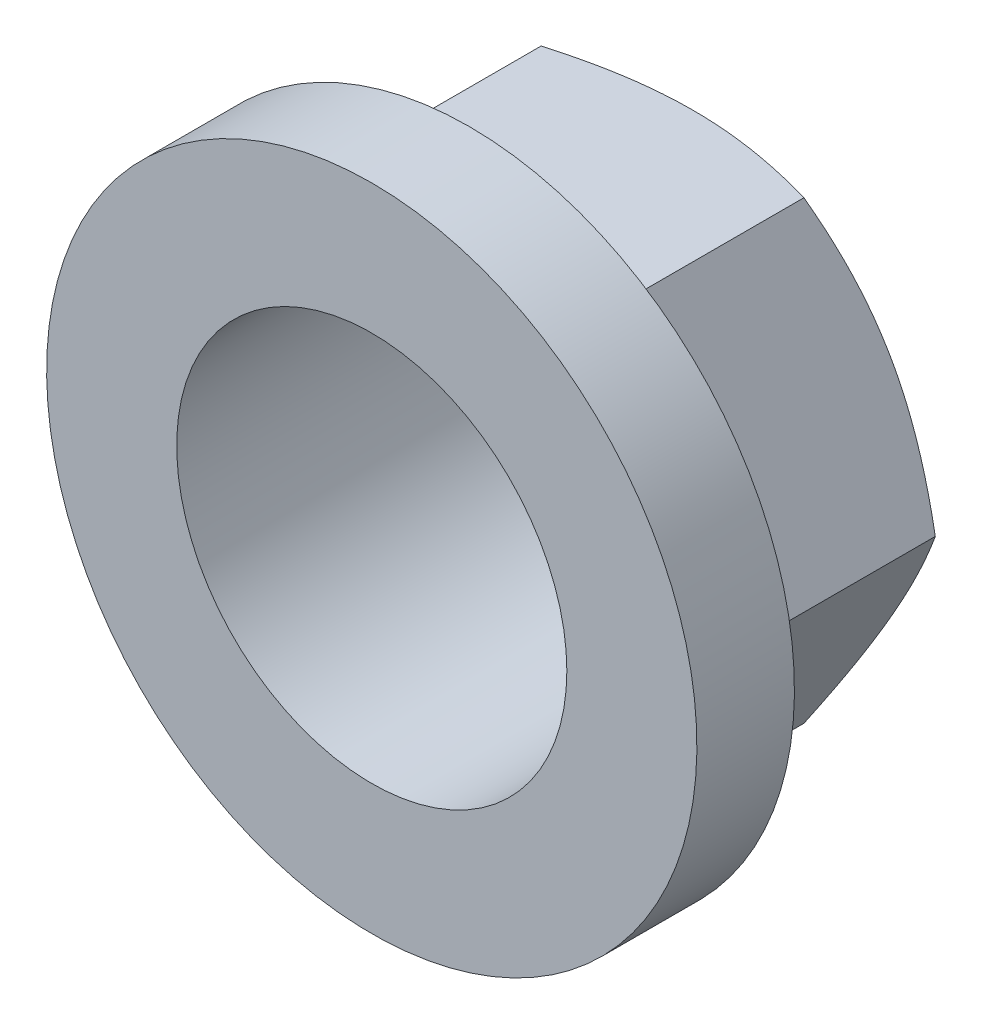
ISO-10303-21;
HEADER;
FILE_DESCRIPTION(('STEP AP214'),'2;1');
FILE_NAME('part.step','',(''),(''),'','','');
FILE_SCHEMA(('AUTOMOTIVE_DESIGN { 1 0 10303 214 1 1 1 1 }'));
ENDSEC;
DATA;
#1=APPLICATION_CONTEXT('core data for automotive mechanical design processes');
#2=APPLICATION_PROTOCOL_DEFINITION('international standard','automotive_design',2000,#1);
#3=PRODUCT_CONTEXT('',#1,'mechanical');
#4=PRODUCT('Part','Part','',(#3));
#5=PRODUCT_RELATED_PRODUCT_CATEGORY('part','',(#4));
#6=PRODUCT_DEFINITION_FORMATION('','',#4);
#7=PRODUCT_DEFINITION_CONTEXT('part definition',#1,'design');
#8=PRODUCT_DEFINITION('design','',#6,#7);
#9=PRODUCT_DEFINITION_SHAPE('','',#8);
#10=(LENGTH_UNIT() NAMED_UNIT(*) SI_UNIT(.MILLI.,.METRE.));
#11=(NAMED_UNIT(*) PLANE_ANGLE_UNIT() SI_UNIT($,.RADIAN.));
#12=(NAMED_UNIT(*) SI_UNIT($,.STERADIAN.) SOLID_ANGLE_UNIT());
#13=UNCERTAINTY_MEASURE_WITH_UNIT(LENGTH_MEASURE(1.E-05),#10,'distance_accuracy_value','');
#14=(GEOMETRIC_REPRESENTATION_CONTEXT(3) GLOBAL_UNCERTAINTY_ASSIGNED_CONTEXT((#13)) GLOBAL_UNIT_ASSIGNED_CONTEXT((#10,
#11,#12)) REPRESENTATION_CONTEXT('',''));
#15=CARTESIAN_POINT('',(0.,0.,0.));
#16=DIRECTION('',(0.,0.,1.));
#17=DIRECTION('',(1.,0.,0.));
#18=AXIS2_PLACEMENT_3D('',#15,#16,#17);
#19=CARTESIAN_POINT('',(0.,0.,3.12478521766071));
#20=DIRECTION('',(0.,0.,-1.));
#21=DIRECTION('',(0.,1.,0.));
#22=AXIS2_PLACEMENT_3D('',#19,#20,#21);
#23=PLANE('',#22);
#24=CARTESIAN_POINT('',(0.,0.,3.12478521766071));
#25=DIRECTION('',(0.,0.,-1.));
#26=DIRECTION('',(0.,1.,0.));
#27=AXIS2_PLACEMENT_3D('',#24,#25,#26);
#28=CIRCLE('',#27,10.);
#29=CARTESIAN_POINT('',(0.,10.,3.12478521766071));
#30=VERTEX_POINT('',#29);
#31=EDGE_CURVE('E252',#30,#30,#28,.T.);
#32=ORIENTED_EDGE('',*,*,#31,.T.);
#33=EDGE_LOOP('',(#32));
#34=FACE_BOUND('',#33,.T.);
#35=DIRECTION('',(-1.,0.,0.));
#36=VECTOR('',#35,1.);
#37=CARTESIAN_POINT('',(-4.04145188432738,-7.,3.12478521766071));
#38=LINE('',#37,#36);
#39=CARTESIAN_POINT('',(4.04145188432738,-7.,3.12478521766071));
#40=VERTEX_POINT('',#39);
#41=CARTESIAN_POINT('',(-4.04145188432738,-7.,3.12478521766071));
#42=VERTEX_POINT('',#41);
#43=EDGE_CURVE('E226',#40,#42,#38,.T.);
#44=ORIENTED_EDGE('',*,*,#43,.F.);
#45=DIRECTION('',(-0.5,-0.866025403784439,0.));
#46=VECTOR('',#45,1.);
#47=CARTESIAN_POINT('',(4.04145188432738,-7.,3.12478521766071));
#48=LINE('',#47,#46);
#49=CARTESIAN_POINT('',(8.08290376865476,0.,3.12478521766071));
#50=VERTEX_POINT('',#49);
#51=EDGE_CURVE('E263',#50,#40,#48,.T.);
#52=ORIENTED_EDGE('',*,*,#51,.F.);
#53=DIRECTION('',(0.5,-0.866025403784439,0.));
#54=VECTOR('',#53,1.);
#55=CARTESIAN_POINT('',(8.08290376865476,0.,3.12478521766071));
#56=LINE('',#55,#54);
#57=CARTESIAN_POINT('',(4.04145188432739,7.,3.12478521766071));
#58=VERTEX_POINT('',#57);
#59=EDGE_CURVE('E114',#58,#50,#56,.T.);
#60=ORIENTED_EDGE('',*,*,#59,.F.);
#61=DIRECTION('',(1.,0.,0.));
#62=VECTOR('',#61,1.);
#63=CARTESIAN_POINT('',(4.04145188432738,7.,3.12478521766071));
#64=LINE('',#63,#62);
#65=CARTESIAN_POINT('',(-4.04145188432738,7.00000000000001,3.12478521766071));
#66=VERTEX_POINT('',#65);
#67=EDGE_CURVE('E109',#66,#58,#64,.T.);
#68=ORIENTED_EDGE('',*,*,#67,.F.);
#69=DIRECTION('',(0.5,0.866025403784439,0.));
#70=VECTOR('',#69,1.);
#71=CARTESIAN_POINT('',(-4.04145188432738,7.,3.12478521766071));
#72=LINE('',#71,#70);
#73=CARTESIAN_POINT('',(-8.08290376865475,0.,3.12478521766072));
#74=VERTEX_POINT('',#73);
#75=EDGE_CURVE('E111',#74,#66,#72,.T.);
#76=ORIENTED_EDGE('',*,*,#75,.F.);
#77=DIRECTION('',(-0.499999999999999,0.866025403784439,0.));
#78=VECTOR('',#77,1.);
#79=CARTESIAN_POINT('',(-8.08290376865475,0.,3.12478521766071));
#80=LINE('',#79,#78);
#81=EDGE_CURVE('E126',#42,#74,#80,.T.);
#82=ORIENTED_EDGE('',*,*,#81,.F.);
#83=EDGE_LOOP('',(#44,#52,#60,#68,#76,#82));
#84=FACE_BOUND('',#83,.T.);
#85=ADVANCED_FACE('F34',(#34,#84),#23,.T.);
#86=CARTESIAN_POINT('',(0.,0.,0.));
#87=DIRECTION('',(0.,0.,-1.));
#88=DIRECTION('',(0.,1.,0.));
#89=AXIS2_PLACEMENT_3D('',#86,#87,#88);
#90=CYLINDRICAL_SURFACE('',#89,10.);
#91=CARTESIAN_POINT('',(0.,0.,6.12478521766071));
#92=DIRECTION('',(0.,0.,-1.));
#93=DIRECTION('',(0.,1.,0.));
#94=AXIS2_PLACEMENT_3D('',#91,#92,#93);
#95=CIRCLE('',#94,10.);
#96=CARTESIAN_POINT('',(0.,10.,6.12478521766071));
#97=VERTEX_POINT('',#96);
#98=EDGE_CURVE('E254',#97,#97,#95,.T.);
#99=ORIENTED_EDGE('',*,*,#98,.T.);
#100=EDGE_LOOP('',(#99));
#101=FACE_BOUND('',#100,.T.);
#102=ORIENTED_EDGE('',*,*,#31,.F.);
#103=EDGE_LOOP('',(#102));
#104=FACE_BOUND('',#103,.T.);
#105=ADVANCED_FACE('F243',(#101,#104),#90,.T.);
#106=CARTESIAN_POINT('',(0.,0.,6.12478521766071));
#107=DIRECTION('',(0.,0.,1.));
#108=DIRECTION('',(0.,-1.,0.));
#109=AXIS2_PLACEMENT_3D('',#106,#107,#108);
#110=PLANE('',#109);
#111=CARTESIAN_POINT('',(0.,0.,6.12478521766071));
#112=DIRECTION('',(0.,0.,1.));
#113=DIRECTION('',(1.,0.,0.));
#114=AXIS2_PLACEMENT_3D('',#111,#112,#113);
#115=CIRCLE('',#114,6.);
#116=CARTESIAN_POINT('',(6.,0.,6.12478521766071));
#117=VERTEX_POINT('',#116);
#118=EDGE_CURVE('E287',#117,#117,#115,.T.);
#119=ORIENTED_EDGE('',*,*,#118,.F.);
#120=EDGE_LOOP('',(#119));
#121=FACE_BOUND('',#120,.T.);
#122=ORIENTED_EDGE('',*,*,#98,.F.);
#123=EDGE_LOOP('',(#122));
#124=FACE_BOUND('',#123,.T.);
#125=ADVANCED_FACE('F248',(#121,#124),#110,.T.);
#126=CARTESIAN_POINT('',(-4.04145188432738,-7.,3.75));
#127=DIRECTION('',(0.,1.,0.));
#128=DIRECTION('',(-1.,0.,0.));
#129=AXIS2_PLACEMENT_3D('',#126,#127,#128);
#130=PLANE('',#129);
#131=DIRECTION('',(0.,0.,-1.));
#132=VECTOR('',#131,1.);
#133=CARTESIAN_POINT('',(4.04145188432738,-7.,3.75));
#134=LINE('',#133,#132);
#135=CARTESIAN_POINT('',(4.04145188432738,-7.,-3.12478521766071));
#136=VERTEX_POINT('',#135);
#137=EDGE_CURVE('E140',#40,#136,#134,.T.);
#138=ORIENTED_EDGE('',*,*,#137,.F.);
#139=ORIENTED_EDGE('',*,*,#43,.T.);
#140=DIRECTION('',(0.,0.,-1.));
#141=VECTOR('',#140,1.);
#142=CARTESIAN_POINT('',(-4.04145188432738,-7.,3.75));
#143=LINE('',#142,#141);
#144=CARTESIAN_POINT('',(-4.04145188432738,-7.,-3.12478521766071));
#145=VERTEX_POINT('',#144);
#146=EDGE_CURVE('E136',#42,#145,#143,.T.);
#147=ORIENTED_EDGE('',*,*,#146,.T.);
#148=CARTESIAN_POINT('',(-10.8928464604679,-7.,-0.315844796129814));
#149=CARTESIAN_POINT('',(-10.5867029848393,-7.,-0.464500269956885));
#150=CARTESIAN_POINT('',(-10.2798605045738,-7.,-0.611740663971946));
#151=CARTESIAN_POINT('',(-9.66440574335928,-7.,-0.902595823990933));
#152=CARTESIAN_POINT('',(-9.35579319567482,-7.,-1.04621002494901));
#153=CARTESIAN_POINT('',(-8.73485529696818,-7.,-1.32973140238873));
#154=CARTESIAN_POINT('',(-8.4225189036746,-7.,-1.46961447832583));
#155=CARTESIAN_POINT('',(-7.79537375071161,-7.,-1.74370236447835));
#156=CARTESIAN_POINT('',(-7.48056510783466,-7.,-1.87790744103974));
#157=CARTESIAN_POINT('',(-6.8378693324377,-7.,-2.14331373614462));
#158=CARTESIAN_POINT('',(-6.50988555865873,-7.,-2.27428221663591));
#159=CARTESIAN_POINT('',(-5.85009595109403,-7.,-2.52639631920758));
#160=CARTESIAN_POINT('',(-5.51828969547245,-7.,-2.64754084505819));
#161=CARTESIAN_POINT('',(-4.85093135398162,-7.,-2.87685500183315));
#162=CARTESIAN_POINT('',(-4.51538826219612,-7.,-2.98505052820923));
#163=CARTESIAN_POINT('',(-3.83950215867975,-7.,-3.18502168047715));
#164=CARTESIAN_POINT('',(-3.49916068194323,-7.,-3.27680243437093));
#165=CARTESIAN_POINT('',(-2.81522305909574,-7.,-3.4390943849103));
#166=CARTESIAN_POINT('',(-2.47165390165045,-7.,-3.50971625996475));
#167=CARTESIAN_POINT('',(-1.95314285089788,-7.,-3.59671847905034));
#168=CARTESIAN_POINT('',(-1.77976757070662,-7.,-3.62256524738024));
#169=CARTESIAN_POINT('',(-1.43214350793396,-7.,-3.66744250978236));
#170=CARTESIAN_POINT('',(-1.25789481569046,-7.,-3.686473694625));
#171=CARTESIAN_POINT('',(-0.911049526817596,-7.,-3.717100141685));
#172=CARTESIAN_POINT('',(-0.738461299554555,-7.,-3.72878980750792));
#173=CARTESIAN_POINT('',(-0.392945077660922,-7.,-3.74485833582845));
#174=CARTESIAN_POINT('',(-0.220017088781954,-7.,-3.74923732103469));
#175=CARTESIAN_POINT('',(0.125872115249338,-7.,-3.75057992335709));
#176=CARTESIAN_POINT('',(0.298833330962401,-7.,-3.74754340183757));
#177=CARTESIAN_POINT('',(0.644473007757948,-7.,-3.73412945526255));
#178=CARTESIAN_POINT('',(0.817151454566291,-7.,-3.72375167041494));
#179=CARTESIAN_POINT('',(1.23087218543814,-7.,-3.69031338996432));
#180=CARTESIAN_POINT('',(1.47164462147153,-7.,-3.66384108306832));
#181=CARTESIAN_POINT('',(1.95141676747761,-7.,-3.59805815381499));
#182=CARTESIAN_POINT('',(2.19041623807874,-7.,-3.55874582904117));
#183=CARTESIAN_POINT('',(2.90445905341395,-7.,-3.42363274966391));
#184=CARTESIAN_POINT('',(3.37630026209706,-7.,-3.31067846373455));
#185=CARTESIAN_POINT('',(4.0821986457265,-7.,-3.11454385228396));
#186=CARTESIAN_POINT('',(4.31990513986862,-7.,-3.04374157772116));
#187=CARTESIAN_POINT('',(4.7930081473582,-7.,-2.89473048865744));
#188=CARTESIAN_POINT('',(5.02840464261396,-7.,-2.81652161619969));
#189=CARTESIAN_POINT('',(5.49696607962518,-7.,-2.65395697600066));
#190=CARTESIAN_POINT('',(5.73013167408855,-7.,-2.5696030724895));
#191=CARTESIAN_POINT('',(6.19452230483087,-7.,-2.39574648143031));
#192=CARTESIAN_POINT('',(6.42574739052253,-7.,-2.30624392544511));
#193=CARTESIAN_POINT('',(7.07139585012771,-7.,-2.04939160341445));
#194=CARTESIAN_POINT('',(7.4838990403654,-7.,-1.87721890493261));
#195=CARTESIAN_POINT('',(8.30453182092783,-7.,-1.52271110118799));
#196=CARTESIAN_POINT('',(8.71266087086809,-7.,-1.34037475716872));
#197=CARTESIAN_POINT('',(9.52561092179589,-7.,-0.968060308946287));
#198=CARTESIAN_POINT('',(9.93043048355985,-7.,-0.778079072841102));
#199=CARTESIAN_POINT('',(10.7372987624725,-7.,-0.392387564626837));
#200=CARTESIAN_POINT('',(11.1393476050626,-7.00000000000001,-0.196677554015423));
#201=CARTESIAN_POINT('',(11.9419246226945,-7.00000000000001,0.199505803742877));
#202=CARTESIAN_POINT('',(12.3424491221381,-7.00000000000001,0.399986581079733));
#203=CARTESIAN_POINT('',(13.1417322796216,-7.00000000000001,0.804441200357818));
#204=CARTESIAN_POINT('',(13.540490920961,-7.00000000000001,1.0084150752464));
#205=CARTESIAN_POINT('',(14.3364753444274,-7.00000000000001,1.41909710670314));
#206=CARTESIAN_POINT('',(14.7337014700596,-7.00000000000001,1.62580459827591));
#207=CARTESIAN_POINT('',(15.526973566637,-7.00000000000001,2.04147304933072));
#208=CARTESIAN_POINT('',(15.9230195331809,-7.00000000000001,2.2504340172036));
#209=CARTESIAN_POINT('',(17.0213557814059,-7.00000000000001,2.83319639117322));
#210=CARTESIAN_POINT('',(17.7225961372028,-7.00000000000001,3.20897611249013));
#211=CARTESIAN_POINT('',(19.1228739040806,-7.00000000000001,3.96472108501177));
#212=CARTESIAN_POINT('',(19.821911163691,-7.00000000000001,4.34468661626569));
#213=CARTESIAN_POINT('',(21.2159219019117,-7.00000000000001,5.10641145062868));
#214=CARTESIAN_POINT('',(21.9109011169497,-7.00000000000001,5.48816026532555));
#215=CARTESIAN_POINT('',(23.2994872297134,-7.00000000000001,6.25401122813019));
#216=CARTESIAN_POINT('',(23.9930942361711,-7.00000000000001,6.63811317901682));
#217=CARTESIAN_POINT('',(24.6862258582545,-7.00000000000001,7.02306517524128));
#218=B_SPLINE_CURVE_WITH_KNOTS('',3,(#148,#149,#150,#151,#152,#153,#154,#155,#156,#157,#158,
#159,#160,#161,#162,#163,#164,#165,#166,#167,#168,#169,#170,#171,#172,#173,#174,#175,#176,#177,
#178,#179,#180,#181,#182,#183,#184,#185,#186,#187,#188,#189,#190,#191,#192,#193,#194,#195,#196,
#197,#198,#199,#200,#201,#202,#203,#204,#205,#206,#207,#208,#209,#210,#211,#212,#213,#214,#215,
#216,#217),.UNSPECIFIED.,.F.,.F.,(4,2,2,2,2,2,2,2,2,2,2,2,2,2,2,2,2,2,2,2,2,2,2,2,2,2,2,2,2,2,2,
2,2,2,4),(0.,1.02099246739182,2.04214305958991,3.06878742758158,4.0953835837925,
5.15475890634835,6.21425227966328,7.27159015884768,8.32859714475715,9.37997449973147,
9.90573557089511,10.4314433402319,10.9502447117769,11.469037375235,11.9878397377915,
12.5066675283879,13.2329284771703,13.9592857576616,15.4127396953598,16.1567571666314,
16.9007804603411,17.6445789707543,18.3883584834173,19.7291255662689,21.070056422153,
22.4115423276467,23.7529670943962,25.0966389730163,26.4403235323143,27.7836870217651,
29.1270555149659,31.5137750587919,33.9006552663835,36.2794216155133,38.6579912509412),.UNSPECIFIED.);
#219=CARTESIAN_POINT('',(0.,-7.,-3.75));
#220=VERTEX_POINT('',#219);
#221=EDGE_CURVE('E211',#220,#145,#218,.F.);
#222=ORIENTED_EDGE('',*,*,#221,.F.);
#223=EDGE_CURVE('E216',#136,#220,#218,.F.);
#224=ORIENTED_EDGE('',*,*,#223,.F.);
#225=EDGE_LOOP('',(#138,#139,#147,#222,#224));
#226=FACE_BOUND('',#225,.T.);
#227=ADVANCED_FACE('F36',(#226),#130,.F.);
#228=CARTESIAN_POINT('',(4.04145188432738,-7.,3.75));
#229=DIRECTION('',(-0.866025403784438,0.5,0.));
#230=DIRECTION('',(-0.5,-0.866025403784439,0.));
#231=AXIS2_PLACEMENT_3D('',#228,#229,#230);
#232=PLANE('',#231);
#233=DIRECTION('',(0.,0.,-1.));
#234=VECTOR('',#233,1.);
#235=CARTESIAN_POINT('',(8.08290376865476,0.,3.75));
#236=LINE('',#235,#234);
#237=CARTESIAN_POINT('',(8.08290376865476,0.,-3.12478521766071));
#238=VERTEX_POINT('',#237);
#239=EDGE_CURVE('E134',#50,#238,#236,.T.);
#240=ORIENTED_EDGE('',*,*,#239,.F.);
#241=ORIENTED_EDGE('',*,*,#51,.T.);
#242=ORIENTED_EDGE('',*,*,#137,.T.);
#243=CARTESIAN_POINT('',(8.0830192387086,0.0002,-3.1247185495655));
#244=CARTESIAN_POINT('',(7.99418356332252,-0.153667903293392,-3.17600015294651));
#245=CARTESIAN_POINT('',(7.90501666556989,-0.308109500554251,-3.22495440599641));
#246=CARTESIAN_POINT('',(7.72595873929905,-0.618246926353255,-3.31756721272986));
#247=CARTESIAN_POINT('',(7.63606741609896,-0.773943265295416,-3.36122348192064));
#248=CARTESIAN_POINT('',(7.36495417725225,-1.24352516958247,-3.4833884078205));
#249=CARTESIAN_POINT('',(7.18266208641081,-1.5592643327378,-3.55287444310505));
#250=CARTESIAN_POINT('',(6.9098652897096,-2.03176224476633,-3.6343550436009));
#251=CARTESIAN_POINT('',(6.82017566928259,-2.18710922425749,-3.65756651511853));
#252=CARTESIAN_POINT('',(6.64039116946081,-2.49850511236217,-3.69648878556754));
#253=CARTESIAN_POINT('',(6.55029632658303,-2.65455395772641,-3.71220024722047));
#254=CARTESIAN_POINT('',(6.36995016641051,-2.96692267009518,-3.73572208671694));
#255=CARTESIAN_POINT('',(6.27969914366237,-3.12324202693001,-3.74354143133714));
#256=CARTESIAN_POINT('',(6.09911871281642,-3.43601650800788,-3.75111975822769));
#257=CARTESIAN_POINT('',(6.00878930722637,-3.59247162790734,-3.75087898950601));
#258=CARTESIAN_POINT('',(5.76131663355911,-4.02110687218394,-3.7391402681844));
#259=CARTESIAN_POINT('',(5.60425437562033,-4.2931466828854,-3.71943425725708));
#260=CARTESIAN_POINT('',(5.29117305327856,-4.8354194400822,-3.65694653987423));
#261=CARTESIAN_POINT('',(5.13515508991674,-5.10565047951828,-3.61414347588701));
#262=CARTESIAN_POINT('',(4.82144370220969,-5.64901454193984,-3.50714832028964));
#263=CARTESIAN_POINT('',(4.66378986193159,-5.92207900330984,-3.44250290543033));
#264=CARTESIAN_POINT('',(4.35083323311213,-6.46413578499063,-3.29578392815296));
#265=CARTESIAN_POINT('',(4.19552643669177,-6.73313504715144,-3.21374482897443));
#266=CARTESIAN_POINT('',(4.04133641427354,-7.0002,-3.1247185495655));
#267=B_SPLINE_CURVE_WITH_KNOTS('',3,(#243,#244,#245,#246,#247,#248,#249,#250,#251,#252,#253,
#254,#255,#256,#257,#258,#259,#260,#261,#262,#263,#264,#265,#266),.UNSPECIFIED.,.F.,.F.,(4,2,2,
2,2,2,2,2,2,2,2,4),(0.,0.554727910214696,1.10969417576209,2.2219327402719,2.76443041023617,
3.30688013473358,3.8487128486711,4.39052882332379,5.33376515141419,6.27787517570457,
7.24292418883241,8.20607866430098),.UNSPECIFIED.);
#268=CARTESIAN_POINT('',(6.06217782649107,-3.5,-3.75));
#269=VERTEX_POINT('',#268);
#270=EDGE_CURVE('E157',#269,#136,#267,.T.);
#271=ORIENTED_EDGE('',*,*,#270,.F.);
#272=EDGE_CURVE('E160',#238,#269,#267,.T.);
#273=ORIENTED_EDGE('',*,*,#272,.F.);
#274=EDGE_LOOP('',(#240,#241,#242,#271,#273));
#275=FACE_BOUND('',#274,.T.);
#276=ADVANCED_FACE('F159',(#275),#232,.F.);
#277=CARTESIAN_POINT('',(8.08290376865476,0.,3.75));
#278=DIRECTION('',(-0.866025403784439,-0.5,0.));
#279=DIRECTION('',(0.5,-0.866025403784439,0.));
#280=AXIS2_PLACEMENT_3D('',#277,#278,#279);
#281=PLANE('',#280);
#282=DIRECTION('',(0.,0.,-1.));
#283=VECTOR('',#282,1.);
#284=CARTESIAN_POINT('',(4.04145188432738,7.,3.75));
#285=LINE('',#284,#283);
#286=CARTESIAN_POINT('',(4.04145188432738,7.,-3.12478521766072));
#287=VERTEX_POINT('',#286);
#288=EDGE_CURVE('E132',#58,#287,#285,.T.);
#289=ORIENTED_EDGE('',*,*,#288,.F.);
#290=ORIENTED_EDGE('',*,*,#59,.T.);
#291=ORIENTED_EDGE('',*,*,#239,.T.);
#292=CARTESIAN_POINT('',(4.04133641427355,7.0002,-3.1247185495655));
#293=CARTESIAN_POINT('',(4.13017208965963,6.8463320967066,-3.17600015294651));
#294=CARTESIAN_POINT('',(4.21933898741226,6.69189049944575,-3.22495440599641));
#295=CARTESIAN_POINT('',(4.39839691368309,6.38175307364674,-3.31756721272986));
#296=CARTESIAN_POINT('',(4.48828823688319,6.22605673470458,-3.36122348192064));
#297=CARTESIAN_POINT('',(4.7594014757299,5.75647483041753,-3.48338840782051));
#298=CARTESIAN_POINT('',(4.94169356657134,5.44073566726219,-3.55287444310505));
#299=CARTESIAN_POINT('',(5.21449036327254,4.96823775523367,-3.6343550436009));
#300=CARTESIAN_POINT('',(5.30417998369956,4.81289077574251,-3.65756651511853));
#301=CARTESIAN_POINT('',(5.48396448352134,4.50149488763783,-3.69648878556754));
#302=CARTESIAN_POINT('',(5.57405932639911,4.34544604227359,-3.71220024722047));
#303=CARTESIAN_POINT('',(5.75440548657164,4.03307732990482,-3.73572208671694));
#304=CARTESIAN_POINT('',(5.84465650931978,3.87675797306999,-3.74354143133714));
#305=CARTESIAN_POINT('',(6.02523694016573,3.56398349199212,-3.75111975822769));
#306=CARTESIAN_POINT('',(6.11556634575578,3.40752837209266,-3.75087898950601));
#307=CARTESIAN_POINT('',(6.36303901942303,2.97889312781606,-3.7391402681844));
#308=CARTESIAN_POINT('',(6.52010127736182,2.7068533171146,-3.71943425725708));
#309=CARTESIAN_POINT('',(6.83318259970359,2.1645805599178,-3.65694653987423));
#310=CARTESIAN_POINT('',(6.98920056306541,1.89434952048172,-3.61414347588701));
#311=CARTESIAN_POINT('',(7.30291195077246,1.35098545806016,-3.50714832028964));
#312=CARTESIAN_POINT('',(7.46056579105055,1.07792099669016,-3.44250290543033));
#313=CARTESIAN_POINT('',(7.77352241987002,0.535864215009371,-3.29578392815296));
#314=CARTESIAN_POINT('',(7.92882921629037,0.26686495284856,-3.21374482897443));
#315=CARTESIAN_POINT('',(8.0830192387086,-0.000199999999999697,-3.1247185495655));
#316=B_SPLINE_CURVE_WITH_KNOTS('',3,(#292,#293,#294,#295,#296,#297,#298,#299,#300,#301,#302,
#303,#304,#305,#306,#307,#308,#309,#310,#311,#312,#313,#314,#315),.UNSPECIFIED.,.F.,.F.,(4,2,2,
2,2,2,2,2,2,2,2,4),(0.,0.554727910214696,1.10969417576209,2.2219327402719,2.76443041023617,
3.30688013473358,3.8487128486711,4.39052882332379,5.33376515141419,6.27787517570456,
7.2429241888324,8.20607866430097),.UNSPECIFIED.);
#317=CARTESIAN_POINT('',(6.06217782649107,3.5,-3.75));
#318=VERTEX_POINT('',#317);
#319=EDGE_CURVE('E177',#318,#238,#316,.T.);
#320=ORIENTED_EDGE('',*,*,#319,.F.);
#321=EDGE_CURVE('E225',#287,#318,#316,.T.);
#322=ORIENTED_EDGE('',*,*,#321,.F.);
#323=EDGE_LOOP('',(#289,#290,#291,#320,#322));
#324=FACE_BOUND('',#323,.T.);
#325=ADVANCED_FACE('F266',(#324),#281,.F.);
#326=CARTESIAN_POINT('',(4.04145188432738,7.,3.75));
#327=DIRECTION('',(0.,-1.,0.));
#328=DIRECTION('',(1.,0.,0.));
#329=AXIS2_PLACEMENT_3D('',#326,#327,#328);
#330=PLANE('',#329);
#331=DIRECTION('',(0.,0.,-1.));
#332=VECTOR('',#331,1.);
#333=CARTESIAN_POINT('',(-4.04145188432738,7.,3.75));
#334=LINE('',#333,#332);
#335=CARTESIAN_POINT('',(-4.04145188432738,7.,-3.12478521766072));
#336=VERTEX_POINT('',#335);
#337=EDGE_CURVE('E123',#66,#336,#334,.T.);
#338=ORIENTED_EDGE('',*,*,#337,.F.);
#339=ORIENTED_EDGE('',*,*,#67,.T.);
#340=ORIENTED_EDGE('',*,*,#288,.T.);
#341=CARTESIAN_POINT('',(-10.8928464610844,7.,-0.315844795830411));
#342=CARTESIAN_POINT('',(-10.586702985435,7.,-0.46450026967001));
#343=CARTESIAN_POINT('',(-10.2798605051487,7.,-0.611740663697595));
#344=CARTESIAN_POINT('',(-9.66440574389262,7.,-0.902595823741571));
#345=CARTESIAN_POINT('',(-9.35579319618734,7.,-1.04621002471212));
#346=CARTESIAN_POINT('',(-8.73485529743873,7.,-1.32973140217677));
#347=CARTESIAN_POINT('',(-8.42251890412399,7.,-1.46961447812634));
#348=CARTESIAN_POINT('',(-7.79537375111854,7.,-1.74370236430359));
#349=CARTESIAN_POINT('',(-7.48056510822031,7.,-1.87790744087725));
#350=CARTESIAN_POINT('',(-6.8378693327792,7.,-2.14331373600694));
#351=CARTESIAN_POINT('',(-6.50988555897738,7.,-2.27428221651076));
#352=CARTESIAN_POINT('',(-5.8500959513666,7.,-2.52639631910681));
#353=CARTESIAN_POINT('',(-5.5182896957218,7.,-2.64754084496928));
#354=CARTESIAN_POINT('',(-4.85093135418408,7.,-2.87685500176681));
#355=CARTESIAN_POINT('',(-4.51538826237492,7.,-2.98505052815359));
#356=CARTESIAN_POINT('',(-3.83950215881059,7.,-3.18502168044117));
#357=CARTESIAN_POINT('',(-3.49916068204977,7.,-3.2768024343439));
#358=CARTESIAN_POINT('',(-2.81522305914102,7.,-3.4390943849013));
#359=CARTESIAN_POINT('',(-2.47165390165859,7.,-3.50971625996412));
#360=CARTESIAN_POINT('',(-1.95314285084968,7.,-3.59671847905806));
#361=CARTESIAN_POINT('',(-1.77976757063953,7.,-3.62256524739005));
#362=CARTESIAN_POINT('',(-1.43214350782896,7.,-3.66744250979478));
#363=CARTESIAN_POINT('',(-1.25789481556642,7.,-3.68647369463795));
#364=CARTESIAN_POINT('',(-0.911049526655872,7.,-3.71710014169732));
#365=CARTESIAN_POINT('',(-0.738461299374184,7.,-3.72878980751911));
#366=CARTESIAN_POINT('',(-0.392945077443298,7.,-3.74485833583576));
#367=CARTESIAN_POINT('',(-0.220017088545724,7.,-3.74923732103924));
#368=CARTESIAN_POINT('',(0.125872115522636,7.,-3.75057992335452));
#369=CARTESIAN_POINT('',(0.298833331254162,7.,-3.74754340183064));
#370=CARTESIAN_POINT('',(0.644473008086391,7.,-3.73412945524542));
#371=CARTESIAN_POINT('',(0.817151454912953,7.,-3.72375167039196));
#372=CARTESIAN_POINT('',(1.23087218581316,7.,-3.69031338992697));
#373=CARTESIAN_POINT('',(1.47164462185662,7.,-3.66384108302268));
#374=CARTESIAN_POINT('',(1.95141676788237,7.,-3.59805815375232));
#375=CARTESIAN_POINT('',(2.19041623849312,7.,-3.55874582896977));
#376=CARTESIAN_POINT('',(2.90445905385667,7.,-3.42363274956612));
#377=CARTESIAN_POINT('',(3.37630026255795,7.,-3.31067846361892));
#378=CARTESIAN_POINT('',(4.08219864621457,7.,-3.11454385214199));
#379=CARTESIAN_POINT('',(4.31990514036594,7.,-3.04374157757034));
#380=CARTESIAN_POINT('',(4.79300814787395,7.,-2.89473048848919));
#381=CARTESIAN_POINT('',(5.02840464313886,7.,-2.81652161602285));
#382=CARTESIAN_POINT('',(5.49696608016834,7.,-2.65395697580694));
#383=CARTESIAN_POINT('',(5.7301316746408,7.,-2.5696030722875));
#384=CARTESIAN_POINT('',(6.19452230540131,7.,-2.39574648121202));
#385=CARTESIAN_POINT('',(6.42574739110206,7.,-2.30624392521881));
#386=CARTESIAN_POINT('',(7.07139585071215,7.,-2.04939160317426));
#387=CARTESIAN_POINT('',(7.48389904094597,7.,-1.87721890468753));
#388=CARTESIAN_POINT('',(8.30453182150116,7.,-1.52271110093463));
#389=CARTESIAN_POINT('',(8.71266087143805,6.99999999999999,-1.34037475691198));
#390=CARTESIAN_POINT('',(9.52561092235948,6.99999999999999,-0.968060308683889));
#391=CARTESIAN_POINT('',(9.93043048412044,6.99999999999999,-0.778079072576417));
#392=CARTESIAN_POINT('',(10.7372987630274,6.99999999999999,-0.392387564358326));
#393=CARTESIAN_POINT('',(11.1393476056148,6.99999999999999,-0.196677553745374));
#394=CARTESIAN_POINT('',(11.9419246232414,6.99999999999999,0.199505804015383));
#395=CARTESIAN_POINT('',(12.3424491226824,6.99999999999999,0.399986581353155));
#396=CARTESIAN_POINT('',(13.1417322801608,6.99999999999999,0.80444120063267));
#397=CARTESIAN_POINT('',(13.5404909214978,6.99999999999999,1.00841507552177));
#398=CARTESIAN_POINT('',(14.3364753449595,6.99999999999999,1.41909710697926));
#399=CARTESIAN_POINT('',(14.7337014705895,6.99999999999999,1.62580459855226));
#400=CARTESIAN_POINT('',(15.5269735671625,6.99999999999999,2.04147304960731));
#401=CARTESIAN_POINT('',(15.9230195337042,6.99999999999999,2.2504340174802));
#402=CARTESIAN_POINT('',(17.0213557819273,6.99999999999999,2.83319639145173));
#403=CARTESIAN_POINT('',(17.7225961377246,6.99999999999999,3.2089761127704));
#404=CARTESIAN_POINT('',(19.1228739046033,6.99999999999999,3.96472108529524));
#405=CARTESIAN_POINT('',(19.8219111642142,6.99999999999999,4.34468661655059));
#406=CARTESIAN_POINT('',(21.2159219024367,6.99999999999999,5.10641145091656));
#407=CARTESIAN_POINT('',(21.910901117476,6.99999999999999,5.48816026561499));
#408=CARTESIAN_POINT('',(23.2994872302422,6.99999999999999,6.25401122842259));
#409=CARTESIAN_POINT('',(23.9930942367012,6.99999999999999,6.63811317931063));
#410=CARTESIAN_POINT('',(24.6862258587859,6.99999999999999,7.02306517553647));
#411=B_SPLINE_CURVE_WITH_KNOTS('',3,(#341,#342,#343,#344,#345,#346,#347,#348,#349,#350,#351,
#352,#353,#354,#355,#356,#357,#358,#359,#360,#361,#362,#363,#364,#365,#366,#367,#368,#369,#370,
#371,#372,#373,#374,#375,#376,#377,#378,#379,#380,#381,#382,#383,#384,#385,#386,#387,#388,#389,
#390,#391,#392,#393,#394,#395,#396,#397,#398,#399,#400,#401,#402,#403,#404,#405,#406,#407,#408,
#409,#410),.UNSPECIFIED.,.F.,.F.,(4,2,2,2,2,2,2,2,2,2,2,2,2,2,2,2,2,2,2,2,2,2,2,2,2,2,2,2,2,2,2,
2,2,2,4),(0.,1.02099246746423,2.04214305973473,3.06878742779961,4.09538358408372,
5.15475890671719,6.21425228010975,7.27159015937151,8.32859714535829,9.37997450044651,
9.90573557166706,10.4314433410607,10.9502447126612,11.4690373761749,11.987839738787,
12.5066675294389,13.232928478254,13.959285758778,15.4127396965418,16.1567571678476,
16.9007804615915,17.6445789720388,18.3883584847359,19.7291255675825,21.0700564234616,
22.41154232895,23.7529670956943,25.0966389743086,26.4403235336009,27.783687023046,
29.1270555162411,31.5137750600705,33.9006552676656,36.2794216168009,38.6579912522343),.UNSPECIFIED.);
#412=CARTESIAN_POINT('',(0.,7.,-3.75));
#413=VERTEX_POINT('',#412);
#414=EDGE_CURVE('E164',#413,#287,#411,.T.);
#415=ORIENTED_EDGE('',*,*,#414,.F.);
#416=EDGE_CURVE('E131',#336,#413,#411,.T.);
#417=ORIENTED_EDGE('',*,*,#416,.F.);
#418=EDGE_LOOP('',(#338,#339,#340,#415,#417));
#419=FACE_BOUND('',#418,.T.);
#420=ADVANCED_FACE('F129',(#419),#330,.F.);
#421=CARTESIAN_POINT('',(-4.04145188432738,7.,3.75));
#422=DIRECTION('',(0.866025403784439,-0.5,0.));
#423=DIRECTION('',(0.5,0.866025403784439,0.));
#424=AXIS2_PLACEMENT_3D('',#421,#422,#423);
#425=PLANE('',#424);
#426=DIRECTION('',(0.,0.,-1.));
#427=VECTOR('',#426,1.);
#428=CARTESIAN_POINT('',(-8.08290376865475,0.,3.75));
#429=LINE('',#428,#427);
#430=CARTESIAN_POINT('',(-8.08290376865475,0.,-3.12478521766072));
#431=VERTEX_POINT('',#430);
#432=EDGE_CURVE('E125',#74,#431,#429,.T.);
#433=ORIENTED_EDGE('',*,*,#432,.F.);
#434=ORIENTED_EDGE('',*,*,#75,.T.);
#435=ORIENTED_EDGE('',*,*,#337,.T.);
#436=CARTESIAN_POINT('',(-8.08301923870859,-0.000199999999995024,-3.1247185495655));
#437=CARTESIAN_POINT('',(-7.99418356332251,0.153667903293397,-3.17600015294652));
#438=CARTESIAN_POINT('',(-7.90501666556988,0.308109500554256,-3.22495440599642));
#439=CARTESIAN_POINT('',(-7.72595873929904,0.618246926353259,-3.31756721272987));
#440=CARTESIAN_POINT('',(-7.63606741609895,0.77394326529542,-3.36122348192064));
#441=CARTESIAN_POINT('',(-7.36495417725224,1.24352516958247,-3.48338840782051));
#442=CARTESIAN_POINT('',(-7.1826620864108,1.55926433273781,-3.55287444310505));
#443=CARTESIAN_POINT('',(-6.9098652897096,2.03176224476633,-3.63435504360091));
#444=CARTESIAN_POINT('',(-6.82017566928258,2.18710922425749,-3.65756651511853));
#445=CARTESIAN_POINT('',(-6.6403911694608,2.49850511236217,-3.69648878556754));
#446=CARTESIAN_POINT('',(-6.55029632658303,2.65455395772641,-3.71220024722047));
#447=CARTESIAN_POINT('',(-6.3699501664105,2.96692267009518,-3.73572208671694));
#448=CARTESIAN_POINT('',(-6.27969914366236,3.12324202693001,-3.74354143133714));
#449=CARTESIAN_POINT('',(-6.09911871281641,3.43601650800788,-3.7511197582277));
#450=CARTESIAN_POINT('',(-6.00878930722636,3.59247162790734,-3.75087898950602));
#451=CARTESIAN_POINT('',(-5.76131663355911,4.02110687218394,-3.7391402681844));
#452=CARTESIAN_POINT('',(-5.60425437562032,4.2931466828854,-3.71943425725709));
#453=CARTESIAN_POINT('',(-5.29117305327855,4.8354194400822,-3.65694653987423));
#454=CARTESIAN_POINT('',(-5.13515508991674,5.10565047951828,-3.61414347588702));
#455=CARTESIAN_POINT('',(-4.82144370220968,5.64901454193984,-3.50714832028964));
#456=CARTESIAN_POINT('',(-4.66378986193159,5.92207900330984,-3.44250290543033));
#457=CARTESIAN_POINT('',(-4.35083323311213,6.46413578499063,-3.29578392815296));
#458=CARTESIAN_POINT('',(-4.19552643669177,6.73313504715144,-3.21374482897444));
#459=CARTESIAN_POINT('',(-4.04133641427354,7.0002,-3.1247185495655));
#460=B_SPLINE_CURVE_WITH_KNOTS('',3,(#436,#437,#438,#439,#440,#441,#442,#443,#444,#445,#446,
#447,#448,#449,#450,#451,#452,#453,#454,#455,#456,#457,#458,#459),.UNSPECIFIED.,.F.,.F.,(4,2,2,
2,2,2,2,2,2,2,2,4),(0.,0.554727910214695,1.10969417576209,2.2219327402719,2.76443041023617,
3.30688013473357,3.8487128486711,4.39052882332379,5.33376515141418,6.27787517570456,
7.24292418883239,8.20607866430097),.UNSPECIFIED.);
#461=CARTESIAN_POINT('',(-6.06217782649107,3.5,-3.75));
#462=VERTEX_POINT('',#461);
#463=EDGE_CURVE('E165',#462,#336,#460,.T.);
#464=ORIENTED_EDGE('',*,*,#463,.F.);
#465=EDGE_CURVE('E205',#431,#462,#460,.T.);
#466=ORIENTED_EDGE('',*,*,#465,.F.);
#467=EDGE_LOOP('',(#433,#434,#435,#464,#466));
#468=FACE_BOUND('',#467,.T.);
#469=ADVANCED_FACE('F121',(#468),#425,.F.);
#470=CARTESIAN_POINT('',(-8.08290376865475,0.,3.75));
#471=DIRECTION('',(0.866025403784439,0.499999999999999,0.));
#472=DIRECTION('',(-0.499999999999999,0.866025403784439,0.));
#473=AXIS2_PLACEMENT_3D('',#470,#471,#472);
#474=PLANE('',#473);
#475=ORIENTED_EDGE('',*,*,#146,.F.);
#476=ORIENTED_EDGE('',*,*,#81,.T.);
#477=ORIENTED_EDGE('',*,*,#432,.T.);
#478=CARTESIAN_POINT('',(-4.04133641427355,-7.0002,-3.1247185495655));
#479=CARTESIAN_POINT('',(-4.13017208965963,-6.84633209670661,-3.17600015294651));
#480=CARTESIAN_POINT('',(-4.21933898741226,-6.69189049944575,-3.22495440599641));
#481=CARTESIAN_POINT('',(-4.39839691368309,-6.38175307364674,-3.31756721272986));
#482=CARTESIAN_POINT('',(-4.48828823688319,-6.22605673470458,-3.36122348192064));
#483=CARTESIAN_POINT('',(-4.75940147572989,-5.75647483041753,-3.4833884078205));
#484=CARTESIAN_POINT('',(-4.94169356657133,-5.4407356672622,-3.55287444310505));
#485=CARTESIAN_POINT('',(-5.21449036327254,-4.96823775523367,-3.63435504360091));
#486=CARTESIAN_POINT('',(-5.30417998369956,-4.81289077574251,-3.65756651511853));
#487=CARTESIAN_POINT('',(-5.48396448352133,-4.50149488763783,-3.69648878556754));
#488=CARTESIAN_POINT('',(-5.57405932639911,-4.34544604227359,-3.71220024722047));
#489=CARTESIAN_POINT('',(-5.75440548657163,-4.03307732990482,-3.73572208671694));
#490=CARTESIAN_POINT('',(-5.84465650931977,-3.87675797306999,-3.74354143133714));
#491=CARTESIAN_POINT('',(-6.02523694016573,-3.56398349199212,-3.7511197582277));
#492=CARTESIAN_POINT('',(-6.11556634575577,-3.40752837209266,-3.75087898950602));
#493=CARTESIAN_POINT('',(-6.36303901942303,-2.97889312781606,-3.7391402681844));
#494=CARTESIAN_POINT('',(-6.52010127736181,-2.7068533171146,-3.71943425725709));
#495=CARTESIAN_POINT('',(-6.83318259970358,-2.1645805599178,-3.65694653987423));
#496=CARTESIAN_POINT('',(-6.9892005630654,-1.89434952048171,-3.61414347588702));
#497=CARTESIAN_POINT('',(-7.30291195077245,-1.35098545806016,-3.50714832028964));
#498=CARTESIAN_POINT('',(-7.46056579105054,-1.07792099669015,-3.44250290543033));
#499=CARTESIAN_POINT('',(-7.77352241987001,-0.535864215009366,-3.29578392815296));
#500=CARTESIAN_POINT('',(-7.92882921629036,-0.266864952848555,-3.21374482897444));
#501=CARTESIAN_POINT('',(-8.08301923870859,0.000200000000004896,-3.1247185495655));
#502=B_SPLINE_CURVE_WITH_KNOTS('',3,(#478,#479,#480,#481,#482,#483,#484,#485,#486,#487,#488,
#489,#490,#491,#492,#493,#494,#495,#496,#497,#498,#499,#500,#501),.UNSPECIFIED.,.F.,.F.,(4,2,2,
2,2,2,2,2,2,2,2,4),(0.,0.554727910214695,1.10969417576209,2.2219327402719,2.76443041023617,
3.30688013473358,3.8487128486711,4.39052882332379,5.33376515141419,6.27787517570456,
7.2429241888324,8.20607866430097),.UNSPECIFIED.);
#503=CARTESIAN_POINT('',(-6.06217782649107,-3.49999999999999,-3.75));
#504=VERTEX_POINT('',#503);
#505=EDGE_CURVE('E197',#504,#431,#502,.T.);
#506=ORIENTED_EDGE('',*,*,#505,.F.);
#507=EDGE_CURVE('E220',#145,#504,#502,.T.);
#508=ORIENTED_EDGE('',*,*,#507,.F.);
#509=EDGE_LOOP('',(#475,#476,#477,#506,#508));
#510=FACE_BOUND('',#509,.T.);
#511=ADVANCED_FACE('F231',(#510),#474,.F.);
#512=CARTESIAN_POINT('',(-4.04145188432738,-7.,-3.75));
#513=DIRECTION('',(0.,0.,-1.));
#514=DIRECTION('',(-1.,0.,0.));
#515=AXIS2_PLACEMENT_3D('',#512,#513,#514);
#516=PLANE('',#515);
#517=CARTESIAN_POINT('',(0.,0.,-3.75));
#518=DIRECTION('',(0.,0.,1.));
#519=DIRECTION('',(1.,0.,0.));
#520=AXIS2_PLACEMENT_3D('',#517,#518,#519);
#521=CIRCLE('',#520,6.);
#522=CARTESIAN_POINT('',(6.,0.,-3.75));
#523=VERTEX_POINT('',#522);
#524=EDGE_CURVE('E258',#523,#523,#521,.T.);
#525=ORIENTED_EDGE('',*,*,#524,.T.);
#526=EDGE_LOOP('',(#525));
#527=FACE_BOUND('',#526,.T.);
#528=CARTESIAN_POINT('',(0.,0.,-3.75));
#529=DIRECTION('',(0.,0.,-1.));
#530=DIRECTION('',(-1.,0.,0.));
#531=AXIS2_PLACEMENT_3D('',#528,#529,#530);
#532=CIRCLE('',#531,7.);
#533=EDGE_CURVE('E39',#504,#462,#532,.T.);
#534=ORIENTED_EDGE('',*,*,#533,.T.);
#535=CARTESIAN_POINT('',(0.,0.,-3.75));
#536=DIRECTION('',(0.,0.,-1.));
#537=DIRECTION('',(-1.,0.,0.));
#538=AXIS2_PLACEMENT_3D('',#535,#536,#537);
#539=CIRCLE('',#538,7.);
#540=EDGE_CURVE('E51',#462,#413,#539,.T.);
#541=ORIENTED_EDGE('',*,*,#540,.T.);
#542=EDGE_CURVE('E11',#413,#318,#532,.T.);
#543=ORIENTED_EDGE('',*,*,#542,.T.);
#544=EDGE_CURVE('E44',#318,#269,#532,.T.);
#545=ORIENTED_EDGE('',*,*,#544,.T.);
#546=EDGE_CURVE('E146',#269,#220,#532,.T.);
#547=ORIENTED_EDGE('',*,*,#546,.T.);
#548=EDGE_CURVE('E59',#220,#504,#532,.T.);
#549=ORIENTED_EDGE('',*,*,#548,.T.);
#550=EDGE_LOOP('',(#534,#541,#543,#545,#547,#549));
#551=FACE_BOUND('',#550,.T.);
#552=ADVANCED_FACE('F151',(#527,#551),#516,.T.);
#553=CARTESIAN_POINT('',(0.,0.,-3.75));
#554=DIRECTION('',(0.,0.,1.));
#555=DIRECTION('',(1.,0.,0.));
#556=AXIS2_PLACEMENT_3D('',#553,#554,#555);
#557=CONICAL_SURFACE('',#556,7.,1.0471975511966);
#558=ORIENTED_EDGE('',*,*,#465,.T.);
#559=ORIENTED_EDGE('',*,*,#533,.F.);
#560=ORIENTED_EDGE('',*,*,#505,.T.);
#561=EDGE_LOOP('',(#558,#559,#560));
#562=FACE_BOUND('',#561,.T.);
#563=ADVANCED_FACE('F191',(#562),#557,.T.);
#564=ORIENTED_EDGE('',*,*,#221,.T.);
#565=ORIENTED_EDGE('',*,*,#507,.T.);
#566=ORIENTED_EDGE('',*,*,#548,.F.);
#567=EDGE_LOOP('',(#564,#565,#566));
#568=FACE_BOUND('',#567,.T.);
#569=ADVANCED_FACE('F233',(#568),#557,.T.);
#570=ORIENTED_EDGE('',*,*,#270,.T.);
#571=ORIENTED_EDGE('',*,*,#223,.T.);
#572=ORIENTED_EDGE('',*,*,#546,.F.);
#573=EDGE_LOOP('',(#570,#571,#572));
#574=FACE_BOUND('',#573,.T.);
#575=ADVANCED_FACE('F235',(#574),#557,.T.);
#576=ORIENTED_EDGE('',*,*,#319,.T.);
#577=ORIENTED_EDGE('',*,*,#272,.T.);
#578=ORIENTED_EDGE('',*,*,#544,.F.);
#579=EDGE_LOOP('',(#576,#577,#578));
#580=FACE_BOUND('',#579,.T.);
#581=ADVANCED_FACE('F189',(#580),#557,.T.);
#582=ORIENTED_EDGE('',*,*,#321,.T.);
#583=ORIENTED_EDGE('',*,*,#542,.F.);
#584=ORIENTED_EDGE('',*,*,#414,.T.);
#585=EDGE_LOOP('',(#582,#583,#584));
#586=FACE_BOUND('',#585,.T.);
#587=ADVANCED_FACE('F183',(#586),#557,.T.);
#588=ORIENTED_EDGE('',*,*,#416,.T.);
#589=ORIENTED_EDGE('',*,*,#540,.F.);
#590=ORIENTED_EDGE('',*,*,#463,.T.);
#591=EDGE_LOOP('',(#588,#589,#590));
#592=FACE_BOUND('',#591,.T.);
#593=ADVANCED_FACE('F188',(#592),#557,.T.);
#594=CARTESIAN_POINT('',(0.,0.,-3.75));
#595=DIRECTION('',(0.,0.,1.));
#596=DIRECTION('',(1.,0.,0.));
#597=AXIS2_PLACEMENT_3D('',#594,#595,#596);
#598=CYLINDRICAL_SURFACE('',#597,6.);
#599=CARTESIAN_POINT('',(6.,0.,-3.75));
#600=CARTESIAN_POINT('',(6.,0.,-3.6471376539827));
#601=CARTESIAN_POINT('',(6.,0.,-3.54427530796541));
#602=CARTESIAN_POINT('',(6.,0.,-3.33855061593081));
#603=CARTESIAN_POINT('',(6.,0.,-3.23568826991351));
#604=CARTESIAN_POINT('',(6.,0.,-3.02996357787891));
#605=CARTESIAN_POINT('',(6.,0.,-2.92710123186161));
#606=CARTESIAN_POINT('',(6.,0.,-2.72137653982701));
#607=CARTESIAN_POINT('',(6.,0.,-2.61851419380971));
#608=CARTESIAN_POINT('',(6.,0.,-2.41278950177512));
#609=CARTESIAN_POINT('',(6.,0.,-2.30992715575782));
#610=CARTESIAN_POINT('',(6.,0.,-2.10420246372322));
#611=CARTESIAN_POINT('',(6.,0.,-2.00134011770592));
#612=CARTESIAN_POINT('',(6.,0.,-1.79561542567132));
#613=CARTESIAN_POINT('',(6.,0.,-1.69275307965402));
#614=CARTESIAN_POINT('',(6.,0.,-1.48702838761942));
#615=CARTESIAN_POINT('',(6.,0.,-1.38416604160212));
#616=CARTESIAN_POINT('',(6.,0.,-1.17844134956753));
#617=CARTESIAN_POINT('',(6.,0.,-1.07557900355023));
#618=CARTESIAN_POINT('',(6.,0.,-0.869854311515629));
#619=CARTESIAN_POINT('',(6.,0.,-0.766991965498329));
#620=CARTESIAN_POINT('',(6.,0.,-0.561267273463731));
#621=CARTESIAN_POINT('',(6.,0.,-0.458404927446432));
#622=CARTESIAN_POINT('',(6.,0.,-0.252680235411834));
#623=CARTESIAN_POINT('',(6.,0.,-0.149817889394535));
#624=CARTESIAN_POINT('',(6.,0.,0.0559068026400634));
#625=CARTESIAN_POINT('',(6.,0.,0.158769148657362));
#626=CARTESIAN_POINT('',(6.,0.,0.364493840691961));
#627=CARTESIAN_POINT('',(6.,0.,0.46735618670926));
#628=CARTESIAN_POINT('',(6.,0.,0.673080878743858));
#629=CARTESIAN_POINT('',(6.,0.,0.775943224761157));
#630=CARTESIAN_POINT('',(6.,0.,0.981667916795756));
#631=CARTESIAN_POINT('',(6.,0.,1.08453026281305));
#632=CARTESIAN_POINT('',(6.,0.,1.29025495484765));
#633=CARTESIAN_POINT('',(6.,0.,1.39311730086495));
#634=CARTESIAN_POINT('',(6.,0.,1.59884199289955));
#635=CARTESIAN_POINT('',(6.,0.,1.70170433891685));
#636=CARTESIAN_POINT('',(6.,0.,1.90742903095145));
#637=CARTESIAN_POINT('',(6.,0.,2.01029137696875));
#638=CARTESIAN_POINT('',(6.,0.,2.21601606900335));
#639=CARTESIAN_POINT('',(6.,0.,2.31887841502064));
#640=CARTESIAN_POINT('',(6.,0.,2.52460310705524));
#641=CARTESIAN_POINT('',(6.,0.,2.62746545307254));
#642=CARTESIAN_POINT('',(6.,0.,2.83319014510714));
#643=CARTESIAN_POINT('',(6.,0.,2.93605249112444));
#644=CARTESIAN_POINT('',(6.,0.,3.14177718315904));
#645=CARTESIAN_POINT('',(6.,0.,3.24463952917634));
#646=CARTESIAN_POINT('',(6.,0.,3.45036422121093));
#647=CARTESIAN_POINT('',(6.,0.,3.55322656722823));
#648=CARTESIAN_POINT('',(6.,0.,3.75895125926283));
#649=CARTESIAN_POINT('',(6.,0.,3.86181360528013));
#650=CARTESIAN_POINT('',(6.,0.,4.06753829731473));
#651=CARTESIAN_POINT('',(6.,0.,4.17040064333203));
#652=CARTESIAN_POINT('',(6.,0.,4.37612533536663));
#653=CARTESIAN_POINT('',(6.,0.,4.47898768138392));
#654=CARTESIAN_POINT('',(6.,0.,4.68471237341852));
#655=CARTESIAN_POINT('',(6.,0.,4.78757471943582));
#656=CARTESIAN_POINT('',(6.,0.,4.99329941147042));
#657=CARTESIAN_POINT('',(6.,0.,5.09616175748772));
#658=CARTESIAN_POINT('',(6.,0.,5.30188644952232));
#659=CARTESIAN_POINT('',(6.,0.,5.40474879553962));
#660=CARTESIAN_POINT('',(6.,0.,5.61047348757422));
#661=CARTESIAN_POINT('',(6.,0.,5.71333583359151));
#662=CARTESIAN_POINT('',(6.,0.,5.91906052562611));
#663=CARTESIAN_POINT('',(6.,0.,6.02192287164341));
#664=CARTESIAN_POINT('',(6.,0.,6.12478521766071));
#665=B_SPLINE_CURVE_WITH_KNOTS('',3,(#599,#600,#601,#602,#603,#604,#605,#606,#607,#608,#609,
#610,#611,#612,#613,#614,#615,#616,#617,#618,#619,#620,#621,#622,#623,#624,#625,#626,#627,#628,
#629,#630,#631,#632,#633,#634,#635,#636,#637,#638,#639,#640,#641,#642,#643,#644,#645,#646,#647,
#648,#649,#650,#651,#652,#653,#654,#655,#656,#657,#658,#659,#660,#661,#662,#663,#664),
.UNSPECIFIED.,.F.,.F.,(4,2,2,2,2,2,2,2,2,2,2,2,2,2,2,2,2,2,2,2,2,2,2,2,2,2,2,2,2,2,2,2,4),(0.,
0.308587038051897,0.617174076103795,0.925761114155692,1.23434815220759,1.54293519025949,
1.85152222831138,2.16010926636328,2.46869630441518,2.77728334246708,3.08587038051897,
3.39445741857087,3.70304445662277,4.01163149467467,4.32021853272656,4.62880557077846,
4.93739260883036,5.24597964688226,5.55456668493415,5.86315372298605,6.17174076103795,
6.48032779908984,6.78891483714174,7.09750187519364,7.40608891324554,7.71467595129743,
8.02326298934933,8.33185002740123,8.64043706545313,8.94902410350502,9.25761114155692,
9.56619817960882,9.87478521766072),.UNSPECIFIED.);
#666=EDGE_CURVE('BSEAM241',#523,#117,#665,.T.);
#667=ORIENTED_EDGE('',*,*,#524,.F.);
#668=ORIENTED_EDGE('',*,*,#118,.T.);
#669=ORIENTED_EDGE('',*,*,#666,.T.);
#670=ORIENTED_EDGE('',*,*,#666,.F.);
#671=EDGE_LOOP('',(#667,#669,#668,#670));
#672=FACE_BOUND('',#671,.T.);
#673=ADVANCED_FACE('F241',(#672),#598,.F.);
#674=CLOSED_SHELL('',(#85,#105,#125,#227,#276,#325,#420,#469,#511,#552,#563,#569,#575,#581,#587,
#593,#673));
#675=MANIFOLD_SOLID_BREP('B2',#674);
#676=ADVANCED_BREP_SHAPE_REPRESENTATION('',(#18,#675),#14);
#677=SHAPE_DEFINITION_REPRESENTATION(#9,#676);
ENDSEC;
END-ISO-10303-21;
